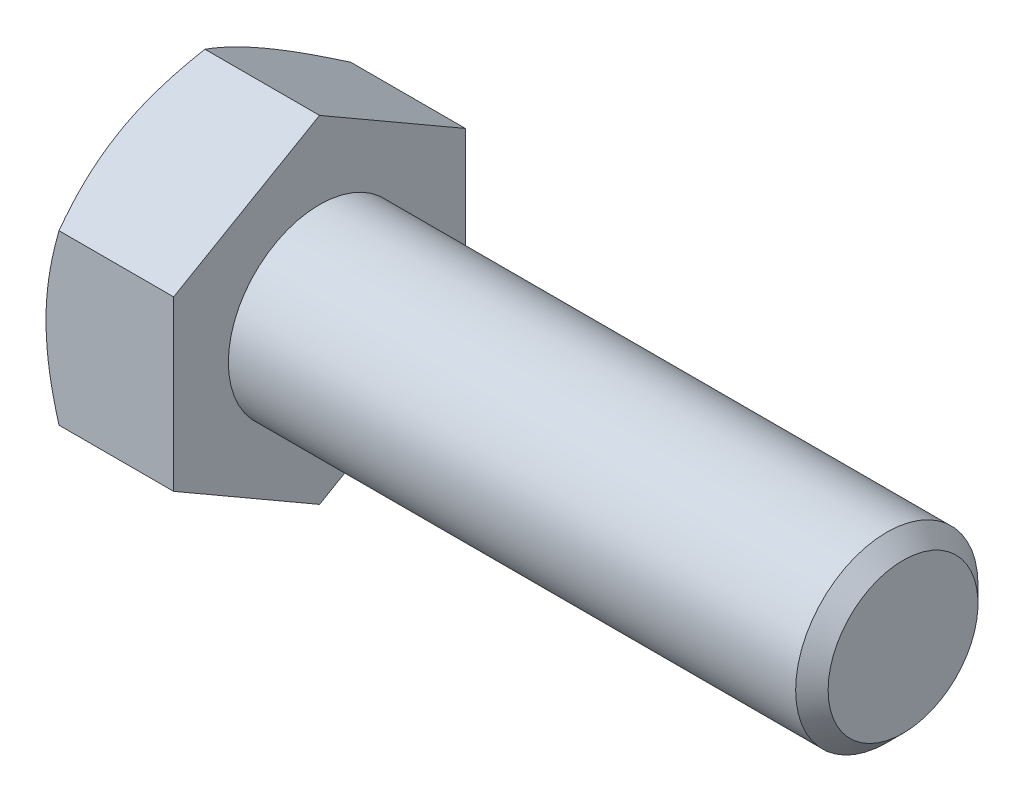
ISO-10303-21;
HEADER;
FILE_DESCRIPTION(('STEP AP214'),'2;1');
FILE_NAME('part.step','',(''),(''),'','','');
FILE_SCHEMA(('AUTOMOTIVE_DESIGN { 1 0 10303 214 1 1 1 1 }'));
ENDSEC;
DATA;
#1=APPLICATION_CONTEXT('core data for automotive mechanical design processes');
#2=APPLICATION_PROTOCOL_DEFINITION('international standard','automotive_design',2000,#1);
#3=PRODUCT_CONTEXT('',#1,'mechanical');
#4=PRODUCT('Part','Part','',(#3));
#5=PRODUCT_RELATED_PRODUCT_CATEGORY('part','',(#4));
#6=PRODUCT_DEFINITION_FORMATION('','',#4);
#7=PRODUCT_DEFINITION_CONTEXT('part definition',#1,'design');
#8=PRODUCT_DEFINITION('design','',#6,#7);
#9=PRODUCT_DEFINITION_SHAPE('','',#8);
#10=(LENGTH_UNIT() NAMED_UNIT(*) SI_UNIT(.MILLI.,.METRE.));
#11=(NAMED_UNIT(*) PLANE_ANGLE_UNIT() SI_UNIT($,.RADIAN.));
#12=(NAMED_UNIT(*) SI_UNIT($,.STERADIAN.) SOLID_ANGLE_UNIT());
#13=UNCERTAINTY_MEASURE_WITH_UNIT(LENGTH_MEASURE(1.E-05),#10,'distance_accuracy_value','');
#14=(GEOMETRIC_REPRESENTATION_CONTEXT(3) GLOBAL_UNCERTAINTY_ASSIGNED_CONTEXT((#13)) GLOBAL_UNIT_ASSIGNED_CONTEXT((#10,
#11,#12)) REPRESENTATION_CONTEXT('',''));
#15=CARTESIAN_POINT('',(0.,0.,0.));
#16=DIRECTION('',(0.,0.,1.));
#17=DIRECTION('',(1.,0.,0.));
#18=AXIS2_PLACEMENT_3D('',#15,#16,#17);
#19=CARTESIAN_POINT('',(0.,4.61880215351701,0.));
#20=DIRECTION('',(1.,0.,0.));
#21=DIRECTION('',(0.,0.,-1.));
#22=AXIS2_PLACEMENT_3D('',#19,#20,#21);
#23=PLANE('',#22);
#24=CARTESIAN_POINT('',(0.,0.,0.));
#25=DIRECTION('',(1.,0.,0.));
#26=DIRECTION('',(0.,0.,-1.));
#27=AXIS2_PLACEMENT_3D('',#24,#25,#26);
#28=CIRCLE('',#27,4.0000000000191);
#29=CARTESIAN_POINT('',(-5.51555329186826E-12,-3.46410161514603,-2.00000000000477));
#30=VERTEX_POINT('',#29);
#31=CARTESIAN_POINT('',(-5.51468593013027E-12,0.,-4.00000000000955));
#32=VERTEX_POINT('',#31);
#33=EDGE_CURVE('E344',#30,#32,#28,.T.);
#34=ORIENTED_EDGE('',*,*,#33,.F.);
#35=CARTESIAN_POINT('',(0.,0.,0.));
#36=DIRECTION('',(1.,0.,0.));
#37=DIRECTION('',(0.,0.,-1.));
#38=AXIS2_PLACEMENT_3D('',#35,#36,#37);
#39=CIRCLE('',#38,4.0000000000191);
#40=CARTESIAN_POINT('',(-5.52943107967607E-12,-3.46410161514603,2.00000000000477));
#41=VERTEX_POINT('',#40);
#42=EDGE_CURVE('E343',#41,#30,#39,.T.);
#43=ORIENTED_EDGE('',*,*,#42,.F.);
#44=CARTESIAN_POINT('',(0.,0.,0.));
#45=DIRECTION('',(1.,0.,0.));
#46=DIRECTION('',(0.,0.,-1.));
#47=AXIS2_PLACEMENT_3D('',#44,#45,#46);
#48=CIRCLE('',#47,4.0000000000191);
#49=CARTESIAN_POINT('',(-5.52682899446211E-12,0.,4.00000000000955));
#50=VERTEX_POINT('',#49);
#51=EDGE_CURVE('E89',#50,#41,#48,.T.);
#52=ORIENTED_EDGE('',*,*,#51,.F.);
#53=CARTESIAN_POINT('',(0.,0.,0.));
#54=DIRECTION('',(1.,0.,0.));
#55=DIRECTION('',(0.,0.,-1.));
#56=AXIS2_PLACEMENT_3D('',#53,#54,#55);
#57=CIRCLE('',#56,4.0000000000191);
#58=CARTESIAN_POINT('',(-5.51034912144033E-12,3.46410161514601,2.00000000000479));
#59=VERTEX_POINT('',#58);
#60=EDGE_CURVE('E87',#59,#50,#57,.T.);
#61=ORIENTED_EDGE('',*,*,#60,.F.);
#62=CARTESIAN_POINT('',(0.,0.,0.));
#63=DIRECTION('',(1.,0.,0.));
#64=DIRECTION('',(0.,0.,-1.));
#65=AXIS2_PLACEMENT_3D('',#62,#63,#64);
#66=CIRCLE('',#65,4.0000000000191);
#67=CARTESIAN_POINT('',(-5.51121648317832E-12,3.46410161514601,-2.00000000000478));
#68=VERTEX_POINT('',#67);
#69=EDGE_CURVE('E20',#68,#59,#66,.T.);
#70=ORIENTED_EDGE('',*,*,#69,.F.);
#71=CARTESIAN_POINT('',(0.,0.,0.));
#72=DIRECTION('',(1.,0.,0.));
#73=DIRECTION('',(0.,0.,-1.));
#74=AXIS2_PLACEMENT_3D('',#71,#72,#73);
#75=CIRCLE('',#74,4.0000000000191);
#76=EDGE_CURVE('E265',#32,#68,#75,.T.);
#77=ORIENTED_EDGE('',*,*,#76,.F.);
#78=EDGE_LOOP('',(#34,#43,#52,#61,#70,#77));
#79=FACE_BOUND('',#78,.T.);
#80=ADVANCED_FACE('F17',(#79),#23,.F.);
#81=CARTESIAN_POINT('',(0.359409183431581,0.,0.));
#82=DIRECTION('',(1.,0.,0.));
#83=DIRECTION('',(0.,0.,-1.));
#84=AXIS2_PLACEMENT_3D('',#81,#82,#83);
#85=CONICAL_SURFACE('',#84,4.62251496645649,1.04719755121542);
#86=CARTESIAN_POINT('',(0.357265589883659,4.61880215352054,6.12357387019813E-12));
#87=CARTESIAN_POINT('',(0.302985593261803,4.52481002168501,-0.162799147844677));
#88=CARTESIAN_POINT('',(0.253255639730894,4.43006516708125,-0.326902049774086));
#89=CARTESIAN_POINT('',(0.165557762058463,4.23974029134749,-0.656554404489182));
#90=CARTESIAN_POINT('',(0.127531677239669,4.14416690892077,-0.822092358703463));
#91=CARTESIAN_POINT('',(0.0808421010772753,3.99990485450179,-1.07196156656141));
#92=CARTESIAN_POINT('',(0.0669981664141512,3.95163526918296,-1.15556694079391));
#93=CARTESIAN_POINT('',(0.0430340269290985,3.85486501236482,-1.32317794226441));
#94=CARTESIAN_POINT('',(0.0329137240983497,3.80636434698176,-1.40718355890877));
#95=CARTESIAN_POINT('',(0.0165746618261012,3.70895253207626,-1.5759057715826));
#96=CARTESIAN_POINT('',(0.0103757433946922,3.66004054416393,-1.66062381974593));
#97=CARTESIAN_POINT('',(0.00207983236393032,3.56212037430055,-1.83022652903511));
#98=CARTESIAN_POINT('',(-1.63478619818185E-05,3.51311217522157,-1.91511121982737));
#99=CARTESIAN_POINT('',(-1.10215656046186E-11,3.46410161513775,-2.));
#100=B_SPLINE_CURVE_WITH_KNOTS('',3,(#86,#87,#88,#89,#90,#91,#92,#93,#94,#95,#96,#97,#98,#99),
.UNSPECIFIED.,.F.,.F.,(4,2,2,2,2,2,4),(0.,0.587229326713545,1.17149154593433,1.4640059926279,
1.75651273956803,2.05048788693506,2.34452123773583),.UNSPECIFIED.);
#101=CARTESIAN_POINT('',(0.357265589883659,4.61880215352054,0.));
#102=VERTEX_POINT('',#101);
#103=EDGE_CURVE('E99',#102,#68,#100,.T.);
#104=ORIENTED_EDGE('',*,*,#103,.T.);
#105=ORIENTED_EDGE('',*,*,#69,.T.);
#106=CARTESIAN_POINT('',(-1.10206982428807E-11,3.46410161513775,2.));
#107=CARTESIAN_POINT('',(-1.63478619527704E-05,3.51311217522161,1.9151112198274));
#108=CARTESIAN_POINT('',(0.00207983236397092,3.5621203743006,1.83022652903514));
#109=CARTESIAN_POINT('',(0.0103757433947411,3.660040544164,1.66062381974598));
#110=CARTESIAN_POINT('',(0.0165746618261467,3.70895253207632,1.57590577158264));
#111=CARTESIAN_POINT('',(0.0329137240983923,3.80636434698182,1.40718355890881));
#112=CARTESIAN_POINT('',(0.0430340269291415,3.85486501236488,1.32317794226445));
#113=CARTESIAN_POINT('',(0.0669981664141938,3.95163526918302,1.15556694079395));
#114=CARTESIAN_POINT('',(0.0808421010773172,3.99990485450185,1.07196156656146));
#115=CARTESIAN_POINT('',(0.127531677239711,4.14416690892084,0.822092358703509));
#116=CARTESIAN_POINT('',(0.165557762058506,4.23974029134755,0.656554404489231));
#117=CARTESIAN_POINT('',(0.253255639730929,4.43006516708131,0.326902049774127));
#118=CARTESIAN_POINT('',(0.302985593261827,4.52481002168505,0.162799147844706));
#119=CARTESIAN_POINT('',(0.357265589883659,4.61880215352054,-6.12357387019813E-12));
#120=B_SPLINE_CURVE_WITH_KNOTS('',3,(#106,#107,#108,#109,#110,#111,#112,#113,#114,#115,#116,
#117,#118,#119),.UNSPECIFIED.,.F.,.F.,(4,2,2,2,2,2,4),(0.,0.294033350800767,0.588008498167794,
0.88051524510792,1.1730296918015,1.75729191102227,2.34452123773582),.UNSPECIFIED.);
#121=EDGE_CURVE('E97',#59,#102,#120,.T.);
#122=ORIENTED_EDGE('',*,*,#121,.T.);
#123=EDGE_LOOP('',(#104,#105,#122));
#124=FACE_BOUND('',#123,.T.);
#125=ADVANCED_FACE('F95',(#124),#85,.T.);
#126=CARTESIAN_POINT('',(0.359409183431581,0.,0.));
#127=DIRECTION('',(1.,0.,0.));
#128=DIRECTION('',(0.,0.,-1.));
#129=AXIS2_PLACEMENT_3D('',#126,#127,#128);
#130=CONICAL_SURFACE('',#129,4.62251496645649,1.04719755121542);
#131=CARTESIAN_POINT('',(0.357265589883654,2.30940107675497,4.00000000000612));
#132=CARTESIAN_POINT('',(0.302985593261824,2.4033932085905,3.83720085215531));
#133=CARTESIAN_POINT('',(0.253255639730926,2.49813806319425,3.6730979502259));
#134=CARTESIAN_POINT('',(0.165557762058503,2.68846293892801,3.3434455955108));
#135=CARTESIAN_POINT('',(0.127531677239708,2.78403632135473,3.17790764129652));
#136=CARTESIAN_POINT('',(0.0808421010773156,2.92829837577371,2.92803843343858));
#137=CARTESIAN_POINT('',(0.0669981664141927,2.97656796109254,2.84443305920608));
#138=CARTESIAN_POINT('',(0.0430340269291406,3.07333821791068,2.67682205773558));
#139=CARTESIAN_POINT('',(0.0329137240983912,3.12183888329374,2.59281644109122));
#140=CARTESIAN_POINT('',(0.0165746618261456,3.21925069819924,2.4240942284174));
#141=CARTESIAN_POINT('',(0.0103757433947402,3.26816268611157,2.33937618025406));
#142=CARTESIAN_POINT('',(0.0020798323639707,3.36608285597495,2.16977347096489));
#143=CARTESIAN_POINT('',(-1.63478619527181E-05,3.41509105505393,2.08488878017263));
#144=CARTESIAN_POINT('',(-1.10206982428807E-11,3.46410161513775,2.));
#145=B_SPLINE_CURVE_WITH_KNOTS('',3,(#131,#132,#133,#134,#135,#136,#137,#138,#139,#140,#141,
#142,#143,#144),.UNSPECIFIED.,.F.,.F.,(4,2,2,2,2,2,4),(0.,0.587229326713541,1.17149154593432,
1.46400599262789,1.75651273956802,2.05048788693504,2.34452123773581),.UNSPECIFIED.);
#146=CARTESIAN_POINT('',(0.357265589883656,2.30940107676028,4.00000000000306));
#147=VERTEX_POINT('',#146);
#148=EDGE_CURVE('E102',#147,#59,#145,.T.);
#149=ORIENTED_EDGE('',*,*,#148,.T.);
#150=ORIENTED_EDGE('',*,*,#60,.T.);
#151=CARTESIAN_POINT('',(-1.10397802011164E-11,0.,4.));
#152=CARTESIAN_POINT('',(-1.63478619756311E-05,0.0980211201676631,4.));
#153=CARTESIAN_POINT('',(0.00207983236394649,0.196037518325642,4.));
#154=CARTESIAN_POINT('',(0.0103757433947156,0.391877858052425,4.));
#155=CARTESIAN_POINT('',(0.0165746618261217,0.489701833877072,4.));
#156=CARTESIAN_POINT('',(0.032913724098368,0.684525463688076,4.));
#157=CARTESIAN_POINT('',(0.0430340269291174,0.781526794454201,4.));
#158=CARTESIAN_POINT('',(0.0669981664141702,0.975067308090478,4.));
#159=CARTESIAN_POINT('',(0.080842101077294,1.07160647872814,4.));
#160=CARTESIAN_POINT('',(0.127531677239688,1.36013058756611,4.));
#161=CARTESIAN_POINT('',(0.165557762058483,1.55127735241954,4.));
#162=CARTESIAN_POINT('',(0.253255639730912,1.93192710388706,4.));
#163=CARTESIAN_POINT('',(0.302985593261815,2.12141681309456,4.));
#164=CARTESIAN_POINT('',(0.357265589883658,2.30940107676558,4.));
#165=B_SPLINE_CURVE_WITH_KNOTS('',3,(#151,#152,#153,#154,#155,#156,#157,#158,#159,#160,#161,
#162,#163,#164),.UNSPECIFIED.,.F.,.F.,(4,2,2,2,2,2,4),(0.,0.29403335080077,0.5880084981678,
0.880515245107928,1.17302969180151,1.75729191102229,2.34452123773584),.UNSPECIFIED.);
#166=EDGE_CURVE('E105',#50,#147,#165,.T.);
#167=ORIENTED_EDGE('',*,*,#166,.T.);
#168=EDGE_LOOP('',(#149,#150,#167));
#169=FACE_BOUND('',#168,.T.);
#170=ADVANCED_FACE('F103',(#169),#130,.T.);
#171=CARTESIAN_POINT('',(0.359409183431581,0.,0.));
#172=DIRECTION('',(1.,0.,0.));
#173=DIRECTION('',(0.,0.,-1.));
#174=AXIS2_PLACEMENT_3D('',#171,#172,#173);
#175=CONICAL_SURFACE('',#174,4.62251496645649,1.04719755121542);
#176=ORIENTED_EDGE('',*,*,#51,.T.);
#177=CARTESIAN_POINT('',(-1.10458517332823E-11,-3.46410161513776,2.));
#178=CARTESIAN_POINT('',(-1.63478619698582E-05,-3.41509105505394,2.08488878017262));
#179=CARTESIAN_POINT('',(0.00207983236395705,-3.36608285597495,2.16977347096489));
#180=CARTESIAN_POINT('',(0.0103757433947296,-3.26816268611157,2.33937618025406));
#181=CARTESIAN_POINT('',(0.0165746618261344,-3.21925069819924,2.4240942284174));
#182=CARTESIAN_POINT('',(0.0329137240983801,-3.12183888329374,2.59281644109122));
#183=CARTESIAN_POINT('',(0.0430340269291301,-3.07333821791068,2.67682205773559));
#184=CARTESIAN_POINT('',(0.0669981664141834,-2.97656796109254,2.84443305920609));
#185=CARTESIAN_POINT('',(0.0808421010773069,-2.92829837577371,2.92803843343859));
#186=CARTESIAN_POINT('',(0.127531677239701,-2.78403632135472,3.17790764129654));
#187=CARTESIAN_POINT('',(0.165557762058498,-2.68846293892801,3.34344559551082));
#188=CARTESIAN_POINT('',(0.253255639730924,-2.49813806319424,3.67309795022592));
#189=CARTESIAN_POINT('',(0.302985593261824,-2.40339320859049,3.83720085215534));
#190=CARTESIAN_POINT('',(0.357265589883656,-2.30940107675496,4.00000000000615));
#191=B_SPLINE_CURVE_WITH_KNOTS('',3,(#177,#178,#179,#180,#181,#182,#183,#184,#185,#186,#187,
#188,#189,#190),.UNSPECIFIED.,.F.,.F.,(4,2,2,2,2,2,4),(0.,0.294033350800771,0.5880084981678,
0.880515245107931,1.17302969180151,1.7572919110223,2.34452123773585),.UNSPECIFIED.);
#192=CARTESIAN_POINT('',(0.357265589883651,-2.30940107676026,4.00000000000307));
#193=VERTEX_POINT('',#192);
#194=EDGE_CURVE('E180',#41,#193,#191,.T.);
#195=ORIENTED_EDGE('',*,*,#194,.T.);
#196=CARTESIAN_POINT('',(0.357265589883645,-2.30940107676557,4.));
#197=CARTESIAN_POINT('',(0.302985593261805,-2.12141681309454,4.));
#198=CARTESIAN_POINT('',(0.253255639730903,-1.93192710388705,4.));
#199=CARTESIAN_POINT('',(0.165557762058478,-1.55127735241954,4.));
#200=CARTESIAN_POINT('',(0.127531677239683,-1.36013058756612,4.));
#201=CARTESIAN_POINT('',(0.080842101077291,-1.07160647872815,4.));
#202=CARTESIAN_POINT('',(0.0669981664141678,-0.975067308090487,4.));
#203=CARTESIAN_POINT('',(0.0430340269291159,-0.781526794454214,4.));
#204=CARTESIAN_POINT('',(0.0329137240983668,-0.684525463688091,4.));
#205=CARTESIAN_POINT('',(0.016574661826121,-0.48970183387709,4.));
#206=CARTESIAN_POINT('',(0.0103757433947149,-0.391877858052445,4.));
#207=CARTESIAN_POINT('',(0.00207983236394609,-0.196037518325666,4.));
#208=CARTESIAN_POINT('',(-1.63478619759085E-05,-0.0980211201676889,4.));
#209=CARTESIAN_POINT('',(-1.10397802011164E-11,0.,4.));
#210=B_SPLINE_CURVE_WITH_KNOTS('',3,(#196,#197,#198,#199,#200,#201,#202,#203,#204,#205,#206,
#207,#208,#209),.UNSPECIFIED.,.F.,.F.,(4,2,2,2,2,2,4),(0.,0.587229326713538,1.17149154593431,
1.46400599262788,1.75651273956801,2.05048788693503,2.3445212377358),.UNSPECIFIED.);
#211=EDGE_CURVE('E152',#193,#50,#210,.T.);
#212=ORIENTED_EDGE('',*,*,#211,.T.);
#213=EDGE_LOOP('',(#176,#195,#212));
#214=FACE_BOUND('',#213,.T.);
#215=ADVANCED_FACE('F142',(#214),#175,.T.);
#216=CARTESIAN_POINT('',(0.359409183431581,0.,0.));
#217=DIRECTION('',(1.,0.,0.));
#218=DIRECTION('',(0.,0.,-1.));
#219=AXIS2_PLACEMENT_3D('',#216,#217,#218);
#220=CONICAL_SURFACE('',#219,4.62251496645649,1.04719755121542);
#221=ORIENTED_EDGE('',*,*,#42,.T.);
#222=CARTESIAN_POINT('',(-1.10319739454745E-11,-3.46410161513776,-2.));
#223=CARTESIAN_POINT('',(-1.63478619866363E-05,-3.51311217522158,-1.91511121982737));
#224=CARTESIAN_POINT('',(0.00207983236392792,-3.56212037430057,-1.83022652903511));
#225=CARTESIAN_POINT('',(0.0103757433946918,-3.66004054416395,-1.66062381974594));
#226=CARTESIAN_POINT('',(0.0165746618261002,-3.70895253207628,-1.5759057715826));
#227=CARTESIAN_POINT('',(0.0329137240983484,-3.80636434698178,-1.40718355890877));
#228=CARTESIAN_POINT('',(0.0430340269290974,-3.85486501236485,-1.32317794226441));
#229=CARTESIAN_POINT('',(0.0669981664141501,-3.95163526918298,-1.15556694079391));
#230=CARTESIAN_POINT('',(0.0808421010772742,-3.99990485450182,-1.07196156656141));
#231=CARTESIAN_POINT('',(0.127531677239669,-4.1441669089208,-0.822092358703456));
#232=CARTESIAN_POINT('',(0.165557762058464,-4.23974029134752,-0.656554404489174));
#233=CARTESIAN_POINT('',(0.253255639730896,-4.43006516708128,-0.326902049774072));
#234=CARTESIAN_POINT('',(0.302985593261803,-4.52481002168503,-0.162799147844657));
#235=CARTESIAN_POINT('',(0.357265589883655,-4.61880215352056,6.15132944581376E-12));
#236=B_SPLINE_CURVE_WITH_KNOTS('',3,(#222,#223,#224,#225,#226,#227,#228,#229,#230,#231,#232,
#233,#234,#235),.UNSPECIFIED.,.F.,.F.,(4,2,2,2,2,2,4),(0.,0.294033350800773,0.588008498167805,
0.880515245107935,1.17302969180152,1.7572919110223,2.34452123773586),.UNSPECIFIED.);
#237=CARTESIAN_POINT('',(0.357265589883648,-4.61880215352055,0.));
#238=VERTEX_POINT('',#237);
#239=EDGE_CURVE('E315',#30,#238,#236,.T.);
#240=ORIENTED_EDGE('',*,*,#239,.T.);
#241=CARTESIAN_POINT('',(0.357265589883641,-4.61880215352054,-6.10969608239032E-12));
#242=CARTESIAN_POINT('',(0.30298559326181,-4.52481002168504,0.162799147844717));
#243=CARTESIAN_POINT('',(0.253255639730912,-4.4300651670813,0.326902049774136));
#244=CARTESIAN_POINT('',(0.165557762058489,-4.23974029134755,0.656554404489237));
#245=CARTESIAN_POINT('',(0.127531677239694,-4.14416690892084,0.822092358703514));
#246=CARTESIAN_POINT('',(0.0808421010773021,-3.99990485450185,1.07196156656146));
#247=CARTESIAN_POINT('',(0.0669981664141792,-3.95163526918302,1.15556694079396));
#248=CARTESIAN_POINT('',(0.0430340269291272,-3.85486501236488,1.32317794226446));
#249=CARTESIAN_POINT('',(0.0329137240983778,-3.80636434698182,1.40718355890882));
#250=CARTESIAN_POINT('',(0.016574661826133,-3.70895253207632,1.57590577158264));
#251=CARTESIAN_POINT('',(0.0103757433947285,-3.660040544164,1.66062381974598));
#252=CARTESIAN_POINT('',(0.00207983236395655,-3.56212037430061,1.83022652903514));
#253=CARTESIAN_POINT('',(-1.63478619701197E-05,-3.51311217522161,1.9151112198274));
#254=CARTESIAN_POINT('',(-1.10458517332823E-11,-3.46410161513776,2.));
#255=B_SPLINE_CURVE_WITH_KNOTS('',3,(#241,#242,#243,#244,#245,#246,#247,#248,#249,#250,#251,
#252,#253,#254),.UNSPECIFIED.,.F.,.F.,(4,2,2,2,2,2,4),(0.,0.587229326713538,1.17149154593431,
1.46400599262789,1.75651273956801,2.05048788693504,2.3445212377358),.UNSPECIFIED.);
#256=EDGE_CURVE('E174',#238,#41,#255,.T.);
#257=ORIENTED_EDGE('',*,*,#256,.T.);
#258=EDGE_LOOP('',(#221,#240,#257));
#259=FACE_BOUND('',#258,.T.);
#260=ADVANCED_FACE('F333',(#259),#220,.T.);
#261=CARTESIAN_POINT('',(0.359409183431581,0.,0.));
#262=DIRECTION('',(1.,0.,0.));
#263=DIRECTION('',(0.,0.,-1.));
#264=AXIS2_PLACEMENT_3D('',#261,#262,#263);
#265=CONICAL_SURFACE('',#264,4.62251496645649,1.04719755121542);
#266=ORIENTED_EDGE('',*,*,#33,.T.);
#267=CARTESIAN_POINT('',(-1.10285044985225E-11,0.,-4.));
#268=CARTESIAN_POINT('',(-1.63478619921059E-05,-0.0980211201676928,-3.99999999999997));
#269=CARTESIAN_POINT('',(0.00207983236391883,-0.196037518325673,-3.99999999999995));
#270=CARTESIAN_POINT('',(0.0103757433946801,-0.391877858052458,-3.99999999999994));
#271=CARTESIAN_POINT('',(0.0165746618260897,-0.489701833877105,-3.99999999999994));
#272=CARTESIAN_POINT('',(0.0329137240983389,-0.684525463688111,-3.99999999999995));
#273=CARTESIAN_POINT('',(0.0430340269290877,-0.781526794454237,-3.99999999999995));
#274=CARTESIAN_POINT('',(0.0669981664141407,-0.975067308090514,-3.99999999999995));
#275=CARTESIAN_POINT('',(0.0808421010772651,-1.07160647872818,-3.99999999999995));
#276=CARTESIAN_POINT('',(0.12753167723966,-1.36013058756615,-3.99999999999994));
#277=CARTESIAN_POINT('',(0.165557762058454,-1.55127735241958,-3.99999999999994));
#278=CARTESIAN_POINT('',(0.253255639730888,-1.9319271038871,-3.99999999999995));
#279=CARTESIAN_POINT('',(0.302985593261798,-2.12141681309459,-3.99999999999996));
#280=CARTESIAN_POINT('',(0.357265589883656,-2.30940107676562,-4.));
#281=B_SPLINE_CURVE_WITH_KNOTS('',3,(#267,#268,#269,#270,#271,#272,#273,#274,#275,#276,#277,
#278,#279,#280),.UNSPECIFIED.,.F.,.F.,(4,2,2,2,2,2,4),(0.,0.294033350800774,0.588008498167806,
0.880515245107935,1.17302969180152,1.7572919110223,2.34452123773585),.UNSPECIFIED.);
#282=CARTESIAN_POINT('',(0.35726558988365,-2.3094010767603,-4.00000000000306));
#283=VERTEX_POINT('',#282);
#284=EDGE_CURVE('E241',#32,#283,#281,.T.);
#285=ORIENTED_EDGE('',*,*,#284,.T.);
#286=CARTESIAN_POINT('',(0.357265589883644,-2.30940107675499,-4.00000000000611));
#287=CARTESIAN_POINT('',(0.302985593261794,-2.40339320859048,-3.83720085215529));
#288=CARTESIAN_POINT('',(0.253255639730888,-2.49813806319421,-3.67309795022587));
#289=CARTESIAN_POINT('',(0.165557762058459,-2.68846293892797,-3.34344559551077));
#290=CARTESIAN_POINT('',(0.127531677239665,-2.78403632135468,-3.17790764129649));
#291=CARTESIAN_POINT('',(0.0808421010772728,-2.92829837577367,-2.92803843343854));
#292=CARTESIAN_POINT('',(0.0669981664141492,-2.9765679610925,-2.84443305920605));
#293=CARTESIAN_POINT('',(0.0430340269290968,-3.07333821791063,-2.67682205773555));
#294=CARTESIAN_POINT('',(0.0329137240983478,-3.12183888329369,-2.59281644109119));
#295=CARTESIAN_POINT('',(0.0165746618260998,-3.21925069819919,-2.42409422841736));
#296=CARTESIAN_POINT('',(0.0103757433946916,-3.26816268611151,-2.33937618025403));
#297=CARTESIAN_POINT('',(0.00207983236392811,-3.36608285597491,-2.16977347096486));
#298=CARTESIAN_POINT('',(-1.63478619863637E-05,-3.41509105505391,-2.08488878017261));
#299=CARTESIAN_POINT('',(-1.10319739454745E-11,-3.46410161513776,-2.));
#300=B_SPLINE_CURVE_WITH_KNOTS('',3,(#286,#287,#288,#289,#290,#291,#292,#293,#294,#295,#296,
#297,#298,#299),.UNSPECIFIED.,.F.,.F.,(4,2,2,2,2,2,4),(0.,0.587229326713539,1.17149154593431,
1.46400599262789,1.75651273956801,2.05048788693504,2.34452123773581),.UNSPECIFIED.);
#301=EDGE_CURVE('E314',#283,#30,#300,.T.);
#302=ORIENTED_EDGE('',*,*,#301,.T.);
#303=EDGE_LOOP('',(#266,#285,#302));
#304=FACE_BOUND('',#303,.T.);
#305=ADVANCED_FACE('F256',(#304),#265,.T.);
#306=CARTESIAN_POINT('',(0.359409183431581,0.,0.));
#307=DIRECTION('',(1.,0.,0.));
#308=DIRECTION('',(0.,0.,-1.));
#309=AXIS2_PLACEMENT_3D('',#306,#307,#308);
#310=CONICAL_SURFACE('',#309,4.62251496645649,1.04719755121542);
#311=CARTESIAN_POINT('',(0.357265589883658,2.30940107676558,-4.));
#312=CARTESIAN_POINT('',(0.302985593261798,2.12141681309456,-3.99999999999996));
#313=CARTESIAN_POINT('',(0.253255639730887,1.93192710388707,-3.99999999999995));
#314=CARTESIAN_POINT('',(0.165557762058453,1.55127735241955,-3.99999999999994));
#315=CARTESIAN_POINT('',(0.127531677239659,1.36013058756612,-3.99999999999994));
#316=CARTESIAN_POINT('',(0.0808421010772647,1.07160647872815,-3.99999999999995));
#317=CARTESIAN_POINT('',(0.0669981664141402,0.975067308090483,-3.99999999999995));
#318=CARTESIAN_POINT('',(0.0430340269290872,0.781526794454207,-3.99999999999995));
#319=CARTESIAN_POINT('',(0.0329137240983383,0.684525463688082,-3.99999999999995));
#320=CARTESIAN_POINT('',(0.0165746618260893,0.489701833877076,-3.99999999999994));
#321=CARTESIAN_POINT('',(0.01037574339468,0.391877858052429,-3.99999999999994));
#322=CARTESIAN_POINT('',(0.00207983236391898,0.196037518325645,-3.99999999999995));
#323=CARTESIAN_POINT('',(-1.63478619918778E-05,0.0980211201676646,-3.99999999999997));
#324=CARTESIAN_POINT('',(-1.10285044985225E-11,0.,-4.));
#325=B_SPLINE_CURVE_WITH_KNOTS('',3,(#311,#312,#313,#314,#315,#316,#317,#318,#319,#320,#321,
#322,#323,#324),.UNSPECIFIED.,.F.,.F.,(4,2,2,2,2,2,4),(0.,0.587229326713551,1.17149154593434,
1.46400599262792,1.75651273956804,2.05048788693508,2.34452123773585),.UNSPECIFIED.);
#326=CARTESIAN_POINT('',(0.357265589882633,2.30940107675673,-4.00000000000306));
#327=VERTEX_POINT('',#326);
#328=EDGE_CURVE('E232',#327,#32,#325,.T.);
#329=ORIENTED_EDGE('',*,*,#328,.T.);
#330=ORIENTED_EDGE('',*,*,#76,.T.);
#331=CARTESIAN_POINT('',(-1.10206982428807E-11,3.46410161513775,-2.));
#332=CARTESIAN_POINT('',(-1.63478619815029E-05,3.41509105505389,-2.0848887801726));
#333=CARTESIAN_POINT('',(0.0020798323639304,3.36608285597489,-2.16977347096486));
#334=CARTESIAN_POINT('',(0.010375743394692,3.26816268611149,-2.33937618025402));
#335=CARTESIAN_POINT('',(0.0165746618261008,3.21925069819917,-2.42409422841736));
#336=CARTESIAN_POINT('',(0.0329137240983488,3.12183888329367,-2.59281644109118));
#337=CARTESIAN_POINT('',(0.0430340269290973,3.07333821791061,-2.67682205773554));
#338=CARTESIAN_POINT('',(0.0669981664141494,2.97656796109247,-2.84443305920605));
#339=CARTESIAN_POINT('',(0.0808421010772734,2.92829837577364,-2.92803843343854));
#340=CARTESIAN_POINT('',(0.127531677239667,2.78403632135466,-3.17790764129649));
#341=CARTESIAN_POINT('',(0.16555776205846,2.68846293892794,-3.34344559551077));
#342=CARTESIAN_POINT('',(0.253255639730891,2.49813806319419,-3.67309795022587));
#343=CARTESIAN_POINT('',(0.302985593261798,2.40339320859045,-3.83720085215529));
#344=CARTESIAN_POINT('',(0.357265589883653,2.30940107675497,-4.00000000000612));
#345=B_SPLINE_CURVE_WITH_KNOTS('',3,(#331,#332,#333,#334,#335,#336,#337,#338,#339,#340,#341,
#342,#343,#344),.UNSPECIFIED.,.F.,.F.,(4,2,2,2,2,2,4),(0.,0.294033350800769,0.588008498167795,
0.880515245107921,1.1730296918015,1.75729191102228,2.34452123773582),.UNSPECIFIED.);
#346=EDGE_CURVE('E115',#68,#327,#345,.T.);
#347=ORIENTED_EDGE('',*,*,#346,.T.);
#348=EDGE_LOOP('',(#329,#330,#347));
#349=FACE_BOUND('',#348,.T.);
#350=ADVANCED_FACE('F251',(#349),#310,.T.);
#351=CARTESIAN_POINT('',(19.5,2.055,0.));
#352=DIRECTION('',(-1.,0.,0.));
#353=DIRECTION('',(0.,0.,1.));
#354=AXIS2_PLACEMENT_3D('',#351,#352,#353);
#355=PLANE('',#354);
#356=CARTESIAN_POINT('',(19.4999999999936,0.,0.));
#357=DIRECTION('',(-1.,0.,0.));
#358=DIRECTION('',(0.,0.,1.));
#359=AXIS2_PLACEMENT_3D('',#356,#357,#358);
#360=CIRCLE('',#359,2.05499999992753);
#361=CARTESIAN_POINT('',(19.4999999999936,0.,2.05499999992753));
#362=VERTEX_POINT('',#361);
#363=EDGE_CURVE('E203',#362,#362,#360,.T.);
#364=ORIENTED_EDGE('',*,*,#363,.F.);
#365=EDGE_LOOP('',(#364));
#366=FACE_BOUND('',#365,.T.);
#367=ADVANCED_FACE('F255',(#366),#355,.F.);
#368=CARTESIAN_POINT('',(3.5,2.30940107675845,-4.));
#369=DIRECTION('',(0.,-0.866025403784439,0.5));
#370=DIRECTION('',(0.,-0.5,-0.866025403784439));
#371=AXIS2_PLACEMENT_3D('',#368,#369,#370);
#372=PLANE('',#371);
#373=DIRECTION('',(1.,0.,0.));
#374=VECTOR('',#373,1.);
#375=CARTESIAN_POINT('',(3.5,4.61880215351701,0.));
#376=LINE('',#375,#374);
#377=CARTESIAN_POINT('',(3.5,4.61880215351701,0.));
#378=VERTEX_POINT('',#377);
#379=EDGE_CURVE('E108',#102,#378,#376,.T.);
#380=ORIENTED_EDGE('',*,*,#379,.T.);
#381=DIRECTION('',(0.,0.5,0.866025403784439));
#382=VECTOR('',#381,1.);
#383=CARTESIAN_POINT('',(3.5,2.30940107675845,-4.));
#384=LINE('',#383,#382);
#385=CARTESIAN_POINT('',(3.5,2.30940107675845,-4.));
#386=VERTEX_POINT('',#385);
#387=EDGE_CURVE('E199',#386,#378,#384,.T.);
#388=ORIENTED_EDGE('',*,*,#387,.F.);
#389=DIRECTION('',(1.,0.,0.));
#390=VECTOR('',#389,1.);
#391=CARTESIAN_POINT('',(3.5,2.30940107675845,-4.));
#392=LINE('',#391,#390);
#393=EDGE_CURVE('E240',#386,#327,#392,.F.);
#394=ORIENTED_EDGE('',*,*,#393,.T.);
#395=ORIENTED_EDGE('',*,*,#346,.F.);
#396=ORIENTED_EDGE('',*,*,#103,.F.);
#397=EDGE_LOOP('',(#380,#388,#394,#395,#396));
#398=FACE_BOUND('',#397,.T.);
#399=ADVANCED_FACE('F267',(#398),#372,.F.);
#400=CARTESIAN_POINT('',(3.5,4.61880215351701,0.));
#401=DIRECTION('',(0.,-0.866025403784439,-0.5));
#402=DIRECTION('',(0.,0.5,-0.866025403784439));
#403=AXIS2_PLACEMENT_3D('',#400,#401,#402);
#404=PLANE('',#403);
#405=DIRECTION('',(-1.,0.,0.));
#406=VECTOR('',#405,1.);
#407=CARTESIAN_POINT('',(3.5,2.30940107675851,4.));
#408=LINE('',#407,#406);
#409=CARTESIAN_POINT('',(3.5,2.30940107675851,4.));
#410=VERTEX_POINT('',#409);
#411=EDGE_CURVE('E151',#147,#410,#408,.F.);
#412=ORIENTED_EDGE('',*,*,#411,.T.);
#413=DIRECTION('',(0.,-0.5,0.866025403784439));
#414=VECTOR('',#413,1.);
#415=CARTESIAN_POINT('',(3.5,4.61880215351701,0.));
#416=LINE('',#415,#414);
#417=EDGE_CURVE('E202',#378,#410,#416,.T.);
#418=ORIENTED_EDGE('',*,*,#417,.F.);
#419=ORIENTED_EDGE('',*,*,#379,.F.);
#420=ORIENTED_EDGE('',*,*,#121,.F.);
#421=ORIENTED_EDGE('',*,*,#148,.F.);
#422=EDGE_LOOP('',(#412,#418,#419,#420,#421));
#423=FACE_BOUND('',#422,.T.);
#424=ADVANCED_FACE('F111',(#423),#404,.F.);
#425=CARTESIAN_POINT('',(3.5,2.3094010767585,4.));
#426=DIRECTION('',(0.,0.,-1.));
#427=DIRECTION('',(-1.,0.,0.));
#428=AXIS2_PLACEMENT_3D('',#425,#426,#427);
#429=PLANE('',#428);
#430=DIRECTION('',(1.,0.,0.));
#431=VECTOR('',#430,1.);
#432=CARTESIAN_POINT('',(3.5,-2.30940107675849,4.00000000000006));
#433=LINE('',#432,#431);
#434=CARTESIAN_POINT('',(3.5,-2.3094010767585,4.00000000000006));
#435=VERTEX_POINT('',#434);
#436=EDGE_CURVE('E185',#193,#435,#433,.T.);
#437=ORIENTED_EDGE('',*,*,#436,.T.);
#438=DIRECTION('',(0.,1.,0.));
#439=VECTOR('',#438,1.);
#440=CARTESIAN_POINT('',(3.5,4.61880215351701,4.00000000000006));
#441=LINE('',#440,#439);
#442=EDGE_CURVE('E219',#410,#435,#441,.F.);
#443=ORIENTED_EDGE('',*,*,#442,.F.);
#444=ORIENTED_EDGE('',*,*,#411,.F.);
#445=ORIENTED_EDGE('',*,*,#166,.F.);
#446=ORIENTED_EDGE('',*,*,#211,.F.);
#447=EDGE_LOOP('',(#437,#443,#444,#445,#446));
#448=FACE_BOUND('',#447,.T.);
#449=ADVANCED_FACE('F158',(#448),#429,.F.);
#450=CARTESIAN_POINT('',(3.5,-2.30940107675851,4.00000000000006));
#451=DIRECTION('',(0.,0.866025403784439,-0.5));
#452=DIRECTION('',(0.,0.5,0.866025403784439));
#453=AXIS2_PLACEMENT_3D('',#450,#451,#452);
#454=PLANE('',#453);
#455=DIRECTION('',(1.,0.,0.));
#456=VECTOR('',#455,1.);
#457=CARTESIAN_POINT('',(3.5,-4.61880215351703,0.));
#458=LINE('',#457,#456);
#459=CARTESIAN_POINT('',(3.5,-4.61880215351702,0.));
#460=VERTEX_POINT('',#459);
#461=EDGE_CURVE('E312',#238,#460,#458,.T.);
#462=ORIENTED_EDGE('',*,*,#461,.T.);
#463=DIRECTION('',(0.,-0.5,-0.866025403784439));
#464=VECTOR('',#463,1.);
#465=CARTESIAN_POINT('',(3.5,-2.30940107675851,4.00000000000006));
#466=LINE('',#465,#464);
#467=EDGE_CURVE('E214',#435,#460,#466,.T.);
#468=ORIENTED_EDGE('',*,*,#467,.F.);
#469=ORIENTED_EDGE('',*,*,#436,.F.);
#470=ORIENTED_EDGE('',*,*,#194,.F.);
#471=ORIENTED_EDGE('',*,*,#256,.F.);
#472=EDGE_LOOP('',(#462,#468,#469,#470,#471));
#473=FACE_BOUND('',#472,.T.);
#474=ADVANCED_FACE('F162',(#473),#454,.F.);
#475=CARTESIAN_POINT('',(3.5,-4.61880215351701,0.));
#476=DIRECTION('',(0.,0.866025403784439,0.5));
#477=DIRECTION('',(0.,-0.5,0.866025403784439));
#478=AXIS2_PLACEMENT_3D('',#475,#476,#477);
#479=PLANE('',#478);
#480=DIRECTION('',(1.,0.,0.));
#481=VECTOR('',#480,1.);
#482=CARTESIAN_POINT('',(3.5,-2.3094010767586,-3.99999999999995));
#483=LINE('',#482,#481);
#484=CARTESIAN_POINT('',(3.5,-2.30940107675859,-3.99999999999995));
#485=VERTEX_POINT('',#484);
#486=EDGE_CURVE('E35',#283,#485,#483,.T.);
#487=ORIENTED_EDGE('',*,*,#486,.T.);
#488=DIRECTION('',(0.,0.5,-0.866025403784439));
#489=VECTOR('',#488,1.);
#490=CARTESIAN_POINT('',(3.5,-4.61880215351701,0.));
#491=LINE('',#490,#489);
#492=EDGE_CURVE('E209',#460,#485,#491,.T.);
#493=ORIENTED_EDGE('',*,*,#492,.F.);
#494=ORIENTED_EDGE('',*,*,#461,.F.);
#495=ORIENTED_EDGE('',*,*,#239,.F.);
#496=ORIENTED_EDGE('',*,*,#301,.F.);
#497=EDGE_LOOP('',(#487,#493,#494,#495,#496));
#498=FACE_BOUND('',#497,.T.);
#499=ADVANCED_FACE('F168',(#498),#479,.F.);
#500=CARTESIAN_POINT('',(3.5,-2.30940107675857,-3.99999999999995));
#501=DIRECTION('',(0.,0.,1.));
#502=DIRECTION('',(1.,0.,0.));
#503=AXIS2_PLACEMENT_3D('',#500,#501,#502);
#504=PLANE('',#503);
#505=ORIENTED_EDGE('',*,*,#393,.F.);
#506=DIRECTION('',(0.,1.,0.));
#507=VECTOR('',#506,1.);
#508=CARTESIAN_POINT('',(3.5,4.61880215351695,-3.99999999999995));
#509=LINE('',#508,#507);
#510=EDGE_CURVE('E206',#485,#386,#509,.T.);
#511=ORIENTED_EDGE('',*,*,#510,.F.);
#512=ORIENTED_EDGE('',*,*,#486,.F.);
#513=ORIENTED_EDGE('',*,*,#284,.F.);
#514=ORIENTED_EDGE('',*,*,#328,.F.);
#515=EDGE_LOOP('',(#505,#511,#512,#513,#514));
#516=FACE_BOUND('',#515,.T.);
#517=ADVANCED_FACE('F248',(#516),#504,.F.);
#518=CARTESIAN_POINT('',(19.0550000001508,0.,0.));
#519=DIRECTION('',(-1.,0.,0.));
#520=DIRECTION('',(0.,0.,1.));
#521=AXIS2_PLACEMENT_3D('',#518,#519,#520);
#522=CONICAL_SURFACE('',#521,2.49999999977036,0.785398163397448);
#523=CARTESIAN_POINT('',(19.055,0.,0.));
#524=DIRECTION('',(-1.,0.,0.));
#525=DIRECTION('',(0.,0.,1.));
#526=AXIS2_PLACEMENT_3D('',#523,#524,#525);
#527=CIRCLE('',#526,2.5);
#528=CARTESIAN_POINT('',(19.055,0.,2.5));
#529=VERTEX_POINT('',#528);
#530=EDGE_CURVE('E26',#529,#529,#527,.T.);
#531=ORIENTED_EDGE('',*,*,#530,.F.);
#532=EDGE_LOOP('',(#531));
#533=FACE_BOUND('',#532,.T.);
#534=ORIENTED_EDGE('',*,*,#363,.T.);
#535=EDGE_LOOP('',(#534));
#536=FACE_BOUND('',#535,.T.);
#537=ADVANCED_FACE('F288',(#533,#536),#522,.T.);
#538=CARTESIAN_POINT('',(3.5,4.61880215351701,0.));
#539=DIRECTION('',(1.,0.,0.));
#540=DIRECTION('',(0.,0.,-1.));
#541=AXIS2_PLACEMENT_3D('',#538,#539,#540);
#542=PLANE('',#541);
#543=CARTESIAN_POINT('',(3.5,0.,0.));
#544=DIRECTION('',(-1.,0.,0.));
#545=DIRECTION('',(0.,0.,1.));
#546=AXIS2_PLACEMENT_3D('',#543,#544,#545);
#547=CIRCLE('',#546,2.5);
#548=CARTESIAN_POINT('',(3.5,0.,2.50000000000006));
#549=VERTEX_POINT('',#548);
#550=EDGE_CURVE('E11',#549,#549,#547,.F.);
#551=ORIENTED_EDGE('',*,*,#550,.F.);
#552=EDGE_LOOP('',(#551));
#553=FACE_BOUND('',#552,.T.);
#554=ORIENTED_EDGE('',*,*,#492,.T.);
#555=ORIENTED_EDGE('',*,*,#510,.T.);
#556=ORIENTED_EDGE('',*,*,#387,.T.);
#557=ORIENTED_EDGE('',*,*,#417,.T.);
#558=ORIENTED_EDGE('',*,*,#442,.T.);
#559=ORIENTED_EDGE('',*,*,#467,.T.);
#560=EDGE_LOOP('',(#554,#555,#556,#557,#558,#559));
#561=FACE_BOUND('',#560,.T.);
#562=ADVANCED_FACE('F281',(#553,#561),#542,.T.);
#563=CARTESIAN_POINT('',(0.,0.,0.));
#564=DIRECTION('',(-1.,0.,0.));
#565=DIRECTION('',(0.,0.,1.));
#566=AXIS2_PLACEMENT_3D('',#563,#564,#565);
#567=CYLINDRICAL_SURFACE('',#566,2.5);
#568=ORIENTED_EDGE('',*,*,#550,.T.);
#569=EDGE_LOOP('',(#568));
#570=FACE_BOUND('',#569,.T.);
#571=ORIENTED_EDGE('',*,*,#530,.T.);
#572=EDGE_LOOP('',(#571));
#573=FACE_BOUND('',#572,.T.);
#574=ADVANCED_FACE('F279',(#570,#573),#567,.T.);
#575=CLOSED_SHELL('',(#80,#125,#170,#215,#260,#305,#350,#367,#399,#424,#449,#474,#499,#517,#537,
#562,#574));
#576=MANIFOLD_SOLID_BREP('B1',#575);
#577=ADVANCED_BREP_SHAPE_REPRESENTATION('',(#18,#576),#14);
#578=SHAPE_DEFINITION_REPRESENTATION(#9,#577);
ENDSEC;
END-ISO-10303-21;
